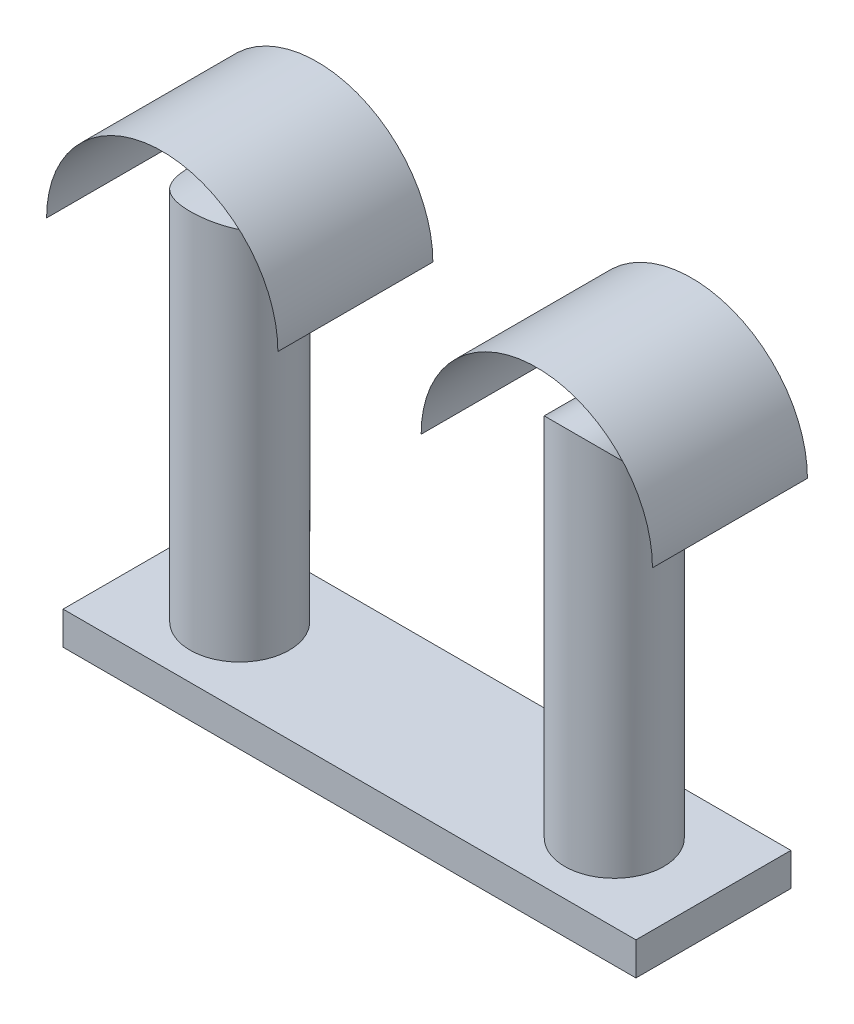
ISO-10303-21;
HEADER;
FILE_DESCRIPTION(('STEP AP214'),'2;1');
FILE_NAME('part.step','',(''),(''),'','','');
FILE_SCHEMA(('AUTOMOTIVE_DESIGN { 1 0 10303 214 1 1 1 1 }'));
ENDSEC;
DATA;
#1=APPLICATION_CONTEXT('core data for automotive mechanical design processes');
#2=APPLICATION_PROTOCOL_DEFINITION('international standard','automotive_design',2000,#1);
#3=PRODUCT_CONTEXT('',#1,'mechanical');
#4=PRODUCT('Part','Part','',(#3));
#5=PRODUCT_RELATED_PRODUCT_CATEGORY('part','',(#4));
#6=PRODUCT_DEFINITION_FORMATION('','',#4);
#7=PRODUCT_DEFINITION_CONTEXT('part definition',#1,'design');
#8=PRODUCT_DEFINITION('design','',#6,#7);
#9=PRODUCT_DEFINITION_SHAPE('','',#8);
#10=(LENGTH_UNIT() NAMED_UNIT(*) SI_UNIT(.MILLI.,.METRE.));
#11=(NAMED_UNIT(*) PLANE_ANGLE_UNIT() SI_UNIT($,.RADIAN.));
#12=(NAMED_UNIT(*) SI_UNIT($,.STERADIAN.) SOLID_ANGLE_UNIT());
#13=UNCERTAINTY_MEASURE_WITH_UNIT(LENGTH_MEASURE(1.E-05),#10,'distance_accuracy_value','');
#14=(GEOMETRIC_REPRESENTATION_CONTEXT(3) GLOBAL_UNCERTAINTY_ASSIGNED_CONTEXT((#13)) GLOBAL_UNIT_ASSIGNED_CONTEXT((#10,
#11,#12)) REPRESENTATION_CONTEXT('',''));
#15=CARTESIAN_POINT('',(0.,0.,0.));
#16=DIRECTION('',(0.,0.,1.));
#17=DIRECTION('',(1.,0.,0.));
#18=AXIS2_PLACEMENT_3D('',#15,#16,#17);
#19=CARTESIAN_POINT('',(56.6767208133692,110.,0.));
#20=DIRECTION('',(0.,0.,1.));
#21=DIRECTION('',(-1.,0.,0.));
#22=AXIS2_PLACEMENT_3D('',#19,#20,#21);
#23=CYLINDRICAL_SURFACE('',#22,35.);
#24=CARTESIAN_POINT('',(56.6767208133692,110.,23.447135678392));
#25=DIRECTION('',(0.,0.,1.));
#26=DIRECTION('',(1.,0.,0.));
#27=AXIS2_PLACEMENT_3D('',#24,#25,#26);
#28=CIRCLE('',#27,35.);
#29=CARTESIAN_POINT('',(91.6767208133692,110.,23.447135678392));
#30=VERTEX_POINT('',#29);
#31=CARTESIAN_POINT('',(21.6767208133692,110.,23.447135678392));
#32=VERTEX_POINT('',#31);
#33=EDGE_CURVE('E81',#30,#32,#28,.T.);
#34=ORIENTED_EDGE('',*,*,#33,.T.);
#35=DIRECTION('',(0.,0.,1.));
#36=VECTOR('',#35,1.);
#37=CARTESIAN_POINT('',(21.6767208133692,110.,0.));
#38=LINE('',#37,#36);
#39=CARTESIAN_POINT('',(21.6767208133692,110.,-23.447135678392));
#40=VERTEX_POINT('',#39);
#41=EDGE_CURVE('E14',#40,#32,#38,.T.);
#42=ORIENTED_EDGE('',*,*,#41,.F.);
#43=CARTESIAN_POINT('',(56.6767208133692,110.,-23.447135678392));
#44=DIRECTION('',(0.,0.,1.));
#45=DIRECTION('',(1.,0.,0.));
#46=AXIS2_PLACEMENT_3D('',#43,#44,#45);
#47=CIRCLE('',#46,35.);
#48=CARTESIAN_POINT('',(91.6767208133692,110.,-23.447135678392));
#49=VERTEX_POINT('',#48);
#50=EDGE_CURVE('E83',#49,#40,#47,.T.);
#51=ORIENTED_EDGE('',*,*,#50,.F.);
#52=DIRECTION('',(0.,0.,1.));
#53=VECTOR('',#52,1.);
#54=CARTESIAN_POINT('',(91.6767208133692,110.,0.));
#55=LINE('',#54,#53);
#56=EDGE_CURVE('E63',#49,#30,#55,.T.);
#57=ORIENTED_EDGE('',*,*,#56,.T.);
#58=EDGE_LOOP('',(#34,#42,#51,#57));
#59=FACE_BOUND('',#58,.T.);
#60=ADVANCED_FACE('F61',(#59),#23,.F.);
#61=OPEN_SHELL('',(#60));
#62=SHELL_BASED_SURFACE_MODEL('B2',(#61));
#63=CARTESIAN_POINT('',(-56.6767208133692,110.,0.));
#64=DIRECTION('',(0.,0.,1.));
#65=DIRECTION('',(1.,0.,0.));
#66=AXIS2_PLACEMENT_3D('',#63,#64,#65);
#67=CYLINDRICAL_SURFACE('',#66,35.);
#68=CARTESIAN_POINT('',(-56.6767208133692,110.,23.447135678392));
#69=DIRECTION('',(0.,0.,-1.));
#70=DIRECTION('',(-1.,0.,0.));
#71=AXIS2_PLACEMENT_3D('',#68,#69,#70);
#72=CIRCLE('',#71,35.);
#73=CARTESIAN_POINT('',(-91.6767208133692,110.,23.447135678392));
#74=VERTEX_POINT('',#73);
#75=CARTESIAN_POINT('',(-21.6767208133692,110.,23.447135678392));
#76=VERTEX_POINT('',#75);
#77=EDGE_CURVE('E131',#74,#76,#72,.T.);
#78=ORIENTED_EDGE('',*,*,#77,.F.);
#79=DIRECTION('',(0.,0.,1.));
#80=VECTOR('',#79,1.);
#81=CARTESIAN_POINT('',(-91.6767208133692,110.,0.));
#82=LINE('',#81,#80);
#83=CARTESIAN_POINT('',(-91.6767208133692,110.,-23.447135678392));
#84=VERTEX_POINT('',#83);
#85=EDGE_CURVE('E124',#84,#74,#82,.T.);
#86=ORIENTED_EDGE('',*,*,#85,.F.);
#87=CARTESIAN_POINT('',(-56.6767208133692,110.,-23.447135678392));
#88=DIRECTION('',(0.,0.,-1.));
#89=DIRECTION('',(-1.,0.,0.));
#90=AXIS2_PLACEMENT_3D('',#87,#88,#89);
#91=CIRCLE('',#90,35.);
#92=CARTESIAN_POINT('',(-21.6767208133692,110.,-23.447135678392));
#93=VERTEX_POINT('',#92);
#94=EDGE_CURVE('E142',#84,#93,#91,.T.);
#95=ORIENTED_EDGE('',*,*,#94,.T.);
#96=DIRECTION('',(0.,0.,1.));
#97=VECTOR('',#96,1.);
#98=CARTESIAN_POINT('',(-21.6767208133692,110.,0.));
#99=LINE('',#98,#97);
#100=EDGE_CURVE('E65',#93,#76,#99,.T.);
#101=ORIENTED_EDGE('',*,*,#100,.T.);
#102=EDGE_LOOP('',(#78,#86,#95,#101));
#103=FACE_BOUND('',#102,.T.);
#104=ADVANCED_FACE('F125',(#103),#67,.F.);
#105=OPEN_SHELL('',(#104));
#106=SHELL_BASED_SURFACE_MODEL('B8',(#105));
#107=CARTESIAN_POINT('',(86.6767208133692,10.,-23.447135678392));
#108=DIRECTION('',(0.,-1.,0.));
#109=DIRECTION('',(0.,0.,-1.));
#110=AXIS2_PLACEMENT_3D('',#107,#108,#109);
#111=PLANE('',#110);
#112=CARTESIAN_POINT('',(-56.6767208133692,10.,0.));
#113=DIRECTION('',(0.,-1.,0.));
#114=DIRECTION('',(0.,0.,-1.));
#115=AXIS2_PLACEMENT_3D('',#112,#113,#114);
#116=CIRCLE('',#115,15.);
#117=CARTESIAN_POINT('',(-56.6767208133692,10.,-15.));
#118=VERTEX_POINT('',#117);
#119=EDGE_CURVE('E177',#118,#118,#116,.F.);
#120=ORIENTED_EDGE('',*,*,#119,.F.);
#121=EDGE_LOOP('',(#120));
#122=FACE_BOUND('',#121,.T.);
#123=DIRECTION('',(0.,0.,-1.));
#124=VECTOR('',#123,1.);
#125=CARTESIAN_POINT('',(86.6767208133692,10.,23.447135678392));
#126=LINE('',#125,#124);
#127=CARTESIAN_POINT('',(86.6767208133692,10.,23.447135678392));
#128=VERTEX_POINT('',#127);
#129=CARTESIAN_POINT('',(86.6767208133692,10.,-23.447135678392));
#130=VERTEX_POINT('',#129);
#131=EDGE_CURVE('E246',#128,#130,#126,.T.);
#132=ORIENTED_EDGE('',*,*,#131,.T.);
#133=DIRECTION('',(-1.,0.,0.));
#134=VECTOR('',#133,1.);
#135=CARTESIAN_POINT('',(-86.6767208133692,10.,-23.447135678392));
#136=LINE('',#135,#134);
#137=CARTESIAN_POINT('',(-86.6767208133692,10.,-23.447135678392));
#138=VERTEX_POINT('',#137);
#139=EDGE_CURVE('E216',#130,#138,#136,.T.);
#140=ORIENTED_EDGE('',*,*,#139,.T.);
#141=DIRECTION('',(0.,0.,1.));
#142=VECTOR('',#141,1.);
#143=CARTESIAN_POINT('',(-86.6767208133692,10.,23.447135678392));
#144=LINE('',#143,#142);
#145=CARTESIAN_POINT('',(-86.6767208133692,10.,23.447135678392));
#146=VERTEX_POINT('',#145);
#147=EDGE_CURVE('E292',#138,#146,#144,.T.);
#148=ORIENTED_EDGE('',*,*,#147,.T.);
#149=DIRECTION('',(1.,0.,0.));
#150=VECTOR('',#149,1.);
#151=CARTESIAN_POINT('',(-86.6767208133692,10.,23.447135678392));
#152=LINE('',#151,#150);
#153=EDGE_CURVE('E190',#146,#128,#152,.T.);
#154=ORIENTED_EDGE('',*,*,#153,.T.);
#155=EDGE_LOOP('',(#132,#140,#148,#154));
#156=FACE_BOUND('',#155,.T.);
#157=CARTESIAN_POINT('',(56.6767208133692,10.,0.));
#158=DIRECTION('',(0.,-1.,0.));
#159=DIRECTION('',(0.,0.,-1.));
#160=AXIS2_PLACEMENT_3D('',#157,#158,#159);
#161=CIRCLE('',#160,15.);
#162=CARTESIAN_POINT('',(56.6767208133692,10.,-15.));
#163=VERTEX_POINT('',#162);
#164=EDGE_CURVE('E119',#163,#163,#161,.F.);
#165=ORIENTED_EDGE('',*,*,#164,.F.);
#166=EDGE_LOOP('',(#165));
#167=FACE_BOUND('',#166,.T.);
#168=ADVANCED_FACE('F167',(#122,#156,#167),#111,.F.);
#169=CARTESIAN_POINT('',(86.6767208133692,10.,23.447135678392));
#170=DIRECTION('',(-1.,0.,0.));
#171=DIRECTION('',(0.,0.,1.));
#172=AXIS2_PLACEMENT_3D('',#169,#170,#171);
#173=PLANE('',#172);
#174=DIRECTION('',(0.,0.,-1.));
#175=VECTOR('',#174,1.);
#176=CARTESIAN_POINT('',(86.6767208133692,0.,23.447135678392));
#177=LINE('',#176,#175);
#178=CARTESIAN_POINT('',(86.6767208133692,0.,23.447135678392));
#179=VERTEX_POINT('',#178);
#180=CARTESIAN_POINT('',(86.6767208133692,0.,-23.447135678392));
#181=VERTEX_POINT('',#180);
#182=EDGE_CURVE('E244',#179,#181,#177,.T.);
#183=ORIENTED_EDGE('',*,*,#182,.T.);
#184=DIRECTION('',(0.,-1.,0.));
#185=VECTOR('',#184,1.);
#186=CARTESIAN_POINT('',(86.6767208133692,10.,-23.447135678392));
#187=LINE('',#186,#185);
#188=EDGE_CURVE('E290',#130,#181,#187,.T.);
#189=ORIENTED_EDGE('',*,*,#188,.F.);
#190=ORIENTED_EDGE('',*,*,#131,.F.);
#191=DIRECTION('',(0.,-1.,0.));
#192=VECTOR('',#191,1.);
#193=CARTESIAN_POINT('',(86.6767208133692,10.,23.447135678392));
#194=LINE('',#193,#192);
#195=EDGE_CURVE('E299',#128,#179,#194,.T.);
#196=ORIENTED_EDGE('',*,*,#195,.T.);
#197=EDGE_LOOP('',(#183,#189,#190,#196));
#198=FACE_BOUND('',#197,.T.);
#199=ADVANCED_FACE('F175',(#198),#173,.F.);
#200=CARTESIAN_POINT('',(-86.6767208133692,10.,-23.447135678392));
#201=DIRECTION('',(0.,0.,1.));
#202=DIRECTION('',(1.,0.,0.));
#203=AXIS2_PLACEMENT_3D('',#200,#201,#202);
#204=PLANE('',#203);
#205=DIRECTION('',(-1.,0.,0.));
#206=VECTOR('',#205,1.);
#207=CARTESIAN_POINT('',(-86.6767208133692,0.,-23.447135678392));
#208=LINE('',#207,#206);
#209=CARTESIAN_POINT('',(-86.6767208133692,0.,-23.447135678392));
#210=VERTEX_POINT('',#209);
#211=EDGE_CURVE('E281',#181,#210,#208,.T.);
#212=ORIENTED_EDGE('',*,*,#211,.T.);
#213=DIRECTION('',(0.,-1.,0.));
#214=VECTOR('',#213,1.);
#215=CARTESIAN_POINT('',(-86.6767208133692,10.,-23.447135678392));
#216=LINE('',#215,#214);
#217=EDGE_CURVE('E283',#138,#210,#216,.T.);
#218=ORIENTED_EDGE('',*,*,#217,.F.);
#219=ORIENTED_EDGE('',*,*,#139,.F.);
#220=ORIENTED_EDGE('',*,*,#188,.T.);
#221=EDGE_LOOP('',(#212,#218,#219,#220));
#222=FACE_BOUND('',#221,.T.);
#223=ADVANCED_FACE('F269',(#222),#204,.F.);
#224=CARTESIAN_POINT('',(-86.6767208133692,10.,23.447135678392));
#225=DIRECTION('',(1.,0.,0.));
#226=DIRECTION('',(0.,0.,-1.));
#227=AXIS2_PLACEMENT_3D('',#224,#225,#226);
#228=PLANE('',#227);
#229=DIRECTION('',(0.,0.,1.));
#230=VECTOR('',#229,1.);
#231=CARTESIAN_POINT('',(-86.6767208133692,0.,23.447135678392));
#232=LINE('',#231,#230);
#233=CARTESIAN_POINT('',(-86.6767208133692,0.,23.447135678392));
#234=VERTEX_POINT('',#233);
#235=EDGE_CURVE('E203',#210,#234,#232,.T.);
#236=ORIENTED_EDGE('',*,*,#235,.T.);
#237=DIRECTION('',(0.,-1.,0.));
#238=VECTOR('',#237,1.);
#239=CARTESIAN_POINT('',(-86.6767208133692,10.,23.447135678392));
#240=LINE('',#239,#238);
#241=EDGE_CURVE('E291',#146,#234,#240,.T.);
#242=ORIENTED_EDGE('',*,*,#241,.F.);
#243=ORIENTED_EDGE('',*,*,#147,.F.);
#244=ORIENTED_EDGE('',*,*,#217,.T.);
#245=EDGE_LOOP('',(#236,#242,#243,#244));
#246=FACE_BOUND('',#245,.T.);
#247=ADVANCED_FACE('F276',(#246),#228,.F.);
#248=CARTESIAN_POINT('',(-86.6767208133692,10.,23.447135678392));
#249=DIRECTION('',(0.,0.,-1.));
#250=DIRECTION('',(-1.,0.,0.));
#251=AXIS2_PLACEMENT_3D('',#248,#249,#250);
#252=PLANE('',#251);
#253=DIRECTION('',(1.,0.,0.));
#254=VECTOR('',#253,1.);
#255=CARTESIAN_POINT('',(-86.6767208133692,0.,23.447135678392));
#256=LINE('',#255,#254);
#257=EDGE_CURVE('E212',#234,#179,#256,.T.);
#258=ORIENTED_EDGE('',*,*,#257,.T.);
#259=ORIENTED_EDGE('',*,*,#195,.F.);
#260=ORIENTED_EDGE('',*,*,#153,.F.);
#261=ORIENTED_EDGE('',*,*,#241,.T.);
#262=EDGE_LOOP('',(#258,#259,#260,#261));
#263=FACE_BOUND('',#262,.T.);
#264=ADVANCED_FACE('F273',(#263),#252,.F.);
#265=CARTESIAN_POINT('',(86.6767208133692,0.,-23.447135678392));
#266=DIRECTION('',(0.,-1.,0.));
#267=DIRECTION('',(0.,0.,-1.));
#268=AXIS2_PLACEMENT_3D('',#265,#266,#267);
#269=PLANE('',#268);
#270=ORIENTED_EDGE('',*,*,#182,.F.);
#271=ORIENTED_EDGE('',*,*,#257,.F.);
#272=ORIENTED_EDGE('',*,*,#235,.F.);
#273=ORIENTED_EDGE('',*,*,#211,.F.);
#274=EDGE_LOOP('',(#270,#271,#272,#273));
#275=FACE_BOUND('',#274,.T.);
#276=ADVANCED_FACE('F275',(#275),#269,.T.);
#277=CARTESIAN_POINT('',(-56.6767208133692,165.001,0.));
#278=DIRECTION('',(0.,-1.,0.));
#279=DIRECTION('',(0.,0.,-1.));
#280=AXIS2_PLACEMENT_3D('',#277,#278,#279);
#281=CYLINDRICAL_SURFACE('',#280,15.);
#282=CARTESIAN_POINT('',(-56.6767208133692,125.,-15.));
#283=CARTESIAN_POINT('',(-56.2758116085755,124.999997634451,-14.9999971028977));
#284=CARTESIAN_POINT('',(-55.8747809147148,124.993093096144,-14.9839057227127));
#285=CARTESIAN_POINT('',(-55.0755880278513,124.965646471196,-14.9196934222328));
#286=CARTESIAN_POINT('',(-54.6774277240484,124.945096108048,-14.8715530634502));
#287=CARTESIAN_POINT('',(-53.8862021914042,124.890838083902,-14.7436069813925));
#288=CARTESIAN_POINT('',(-53.4931505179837,124.857100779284,-14.6637299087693));
#289=CARTESIAN_POINT('',(-52.7159437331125,124.777361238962,-14.4731590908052));
#290=CARTESIAN_POINT('',(-52.3317873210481,124.731360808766,-14.3624698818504));
#291=CARTESIAN_POINT('',(-51.5761819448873,124.628447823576,-14.1117825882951));
#292=CARTESIAN_POINT('',(-51.2046936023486,124.571573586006,-13.9718872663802));
#293=CARTESIAN_POINT('',(-50.4753046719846,124.448211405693,-13.6637911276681));
#294=CARTESIAN_POINT('',(-50.1174045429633,124.381723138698,-13.4955893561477));
#295=CARTESIAN_POINT('',(-49.4174207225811,124.240764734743,-13.1323253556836));
#296=CARTESIAN_POINT('',(-49.0753284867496,124.166298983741,-12.9372778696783));
#297=CARTESIAN_POINT('',(-48.40841435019,124.011062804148,-12.5215646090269));
#298=CARTESIAN_POINT('',(-48.0835992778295,123.93028991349,-12.3008888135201));
#299=CARTESIAN_POINT('',(-47.4379000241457,123.760345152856,-11.8242471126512));
#300=CARTESIAN_POINT('',(-47.1179455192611,123.670956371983,-11.5670986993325));
#301=CARTESIAN_POINT('',(-46.5005755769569,123.489544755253,-11.0278766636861));
#302=CARTESIAN_POINT('',(-46.2031610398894,123.397521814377,-10.7458020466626));
#303=CARTESIAN_POINT('',(-45.6323140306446,123.213116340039,-10.1581955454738));
#304=CARTESIAN_POINT('',(-45.3588923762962,123.120733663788,-9.85265319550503));
#305=CARTESIAN_POINT('',(-44.8376558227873,122.938015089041,-9.21979517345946));
#306=CARTESIAN_POINT('',(-44.5898451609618,122.847679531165,-8.89247591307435));
#307=CARTESIAN_POINT('',(-44.1089484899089,122.666811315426,-8.19988511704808));
#308=CARTESIAN_POINT('',(-43.8773403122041,122.576522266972,-7.83352144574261));
#309=CARTESIAN_POINT('',(-43.4461006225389,122.403775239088,-7.08086972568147));
#310=CARTESIAN_POINT('',(-43.2464558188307,122.321314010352,-6.69459004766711));
#311=CARTESIAN_POINT('',(-42.8808216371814,122.166948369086,-5.90445692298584));
#312=CARTESIAN_POINT('',(-42.7148256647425,122.0950418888,-5.50060693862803));
#313=CARTESIAN_POINT('',(-42.4181548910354,121.964349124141,-4.67807553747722));
#314=CARTESIAN_POINT('',(-42.2874772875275,121.90556179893,-4.25939530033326));
#315=CARTESIAN_POINT('',(-42.0685912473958,121.805915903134,-3.43169282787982));
#316=CARTESIAN_POINT('',(-41.9785838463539,121.764306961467,-3.02323680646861));
#317=CARTESIAN_POINT('',(-41.832879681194,121.696480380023,-2.19897823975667));
#318=CARTESIAN_POINT('',(-41.7771818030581,121.670262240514,-1.7831759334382));
#319=CARTESIAN_POINT('',(-41.7008286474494,121.634229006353,-0.947870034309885));
#320=CARTESIAN_POINT('',(-41.6801553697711,121.624405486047,-0.528368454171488));
#321=CARTESIAN_POINT('',(-41.674074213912,121.621521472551,0.310936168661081));
#322=CARTESIAN_POINT('',(-41.688664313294,121.628460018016,0.730739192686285));
#323=CARTESIAN_POINT('',(-41.7502627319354,121.657571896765,1.53266432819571));
#324=CARTESIAN_POINT('',(-41.7945104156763,121.67844732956,1.91504971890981));
#325=CARTESIAN_POINT('',(-41.9120510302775,121.733400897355,2.67433973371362));
#326=CARTESIAN_POINT('',(-41.9853421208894,121.767478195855,3.05124470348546));
#327=CARTESIAN_POINT('',(-42.1602324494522,121.847775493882,3.7971494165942));
#328=CARTESIAN_POINT('',(-42.2618359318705,121.893997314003,4.16614796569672));
#329=CARTESIAN_POINT('',(-42.4923982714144,121.997201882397,4.89394777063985));
#330=CARTESIAN_POINT('',(-42.6213582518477,122.054185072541,5.25274860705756));
#331=CARTESIAN_POINT('',(-42.9086212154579,122.178633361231,5.96576381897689));
#332=CARTESIAN_POINT('',(-43.067497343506,122.246298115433,6.31971214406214));
#333=CARTESIAN_POINT('',(-43.4115086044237,122.389332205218,7.01313102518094));
#334=CARTESIAN_POINT('',(-43.5966532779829,122.464704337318,7.35259626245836));
#335=CARTESIAN_POINT('',(-43.9919414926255,122.621182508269,8.01531402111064));
#336=CARTESIAN_POINT('',(-44.2020885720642,122.70228935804,8.33856423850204));
#337=CARTESIAN_POINT('',(-44.6461227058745,122.868235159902,8.96732162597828));
#338=CARTESIAN_POINT('',(-44.8800111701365,122.953074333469,9.2728277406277));
#339=CARTESIAN_POINT('',(-45.3924177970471,123.132229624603,9.89141119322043));
#340=CARTESIAN_POINT('',(-45.6730586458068,123.226710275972,10.2026855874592));
#341=CARTESIAN_POINT('',(-46.2593461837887,123.415162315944,10.8006280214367));
#342=CARTESIAN_POINT('',(-46.5649832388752,123.509133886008,11.0873054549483));
#343=CARTESIAN_POINT('',(-47.1999074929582,123.694204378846,11.63468111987));
#344=CARTESIAN_POINT('',(-47.5292108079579,123.78530128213,11.8953613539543));
#345=CARTESIAN_POINT('',(-48.2093334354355,123.962136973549,12.388694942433));
#346=CARTESIAN_POINT('',(-48.560143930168,124.047877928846,12.6213596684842));
#347=CARTESIAN_POINT('',(-49.2908021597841,124.213917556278,13.0627356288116));
#348=CARTESIAN_POINT('',(-49.6711679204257,124.294016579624,13.2706661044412));
#349=CARTESIAN_POINT('',(-50.4501435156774,124.443969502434,13.6535001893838));
#350=CARTESIAN_POINT('',(-50.8487538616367,124.513823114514,13.8284028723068));
#351=CARTESIAN_POINT('',(-51.6612178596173,124.641214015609,14.1433536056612));
#352=CARTESIAN_POINT('',(-52.0750642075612,124.69875711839,14.2834181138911));
#353=CARTESIAN_POINT('',(-52.9149833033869,124.799830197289,14.5272333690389));
#354=CARTESIAN_POINT('',(-53.3410550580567,124.843361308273,14.6309870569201));
#355=CARTESIAN_POINT('',(-54.173404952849,124.912692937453,14.7953129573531));
#356=CARTESIAN_POINT('',(-54.5791282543,124.939475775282,14.8582874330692));
#357=CARTESIAN_POINT('',(-55.3950502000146,124.978909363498,14.9507813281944));
#358=CARTESIAN_POINT('',(-55.8052486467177,124.991560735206,14.980302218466));
#359=CARTESIAN_POINT('',(-56.6267640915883,125.002374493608,15.005543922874));
#360=CARTESIAN_POINT('',(-57.0380807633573,125.000540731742,15.0012737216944));
#361=CARTESIAN_POINT('',(-57.8586509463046,124.982444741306,14.9590042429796));
#362=CARTESIAN_POINT('',(-58.2679045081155,124.96618286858,14.9210057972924));
#363=CARTESIAN_POINT('',(-59.0594520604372,124.920929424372,14.8146373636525));
#364=CARTESIAN_POINT('',(-59.4420211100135,124.892661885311,14.7479925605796));
#365=CARTESIAN_POINT('',(-60.1998166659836,124.824309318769,14.5855390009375));
#366=CARTESIAN_POINT('',(-60.5750434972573,124.784224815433,14.4897315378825));
#367=CARTESIAN_POINT('',(-61.3157828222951,124.693203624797,14.2698418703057));
#368=CARTESIAN_POINT('',(-61.6812946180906,124.642266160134,14.1457576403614));
#369=CARTESIAN_POINT('',(-62.4004015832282,124.53073835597,13.8703904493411));
#370=CARTESIAN_POINT('',(-62.7539963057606,124.470147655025,13.7191064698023));
#371=CARTESIAN_POINT('',(-63.4581208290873,124.338678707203,13.385406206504));
#372=CARTESIAN_POINT('',(-63.8082111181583,124.267538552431,13.2021661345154));
#373=CARTESIAN_POINT('',(-64.4917248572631,124.118149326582,12.8094141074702));
#374=CARTESIAN_POINT('',(-64.825148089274,124.039900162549,12.5999018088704));
#375=CARTESIAN_POINT('',(-65.4737026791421,123.878087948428,12.1559683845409));
#376=CARTESIAN_POINT('',(-65.7888304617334,123.794523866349,11.9215424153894));
#377=CARTESIAN_POINT('',(-66.3993040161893,123.623977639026,11.4291394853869));
#378=CARTESIAN_POINT('',(-66.6946426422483,123.536994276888,11.1711540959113));
#379=CARTESIAN_POINT('',(-67.2854534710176,123.355020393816,10.6128306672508));
#380=CARTESIAN_POINT('',(-67.5792629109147,123.259919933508,10.3107664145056));
#381=CARTESIAN_POINT('',(-68.1405896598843,123.070643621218,9.68282409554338));
#382=CARTESIAN_POINT('',(-68.4081052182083,122.976467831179,9.35694444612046));
#383=CARTESIAN_POINT('',(-68.9153204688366,122.791608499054,8.68300744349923));
#384=CARTESIAN_POINT('',(-69.1550066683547,122.700926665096,8.3349394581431));
#385=CARTESIAN_POINT('',(-69.6046822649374,122.52577490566,7.61882491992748));
#386=CARTESIAN_POINT('',(-69.8146834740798,122.441302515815,7.2507863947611));
#387=CARTESIAN_POINT('',(-70.2070119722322,122.279669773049,6.48982121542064));
#388=CARTESIAN_POINT('',(-70.3887637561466,122.202671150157,6.09656276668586));
#389=CARTESIAN_POINT('',(-70.7181761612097,122.060407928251,5.29393031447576));
#390=CARTESIAN_POINT('',(-70.8658360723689,121.995143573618,4.88455597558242));
#391=CARTESIAN_POINT('',(-71.1253553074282,121.878789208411,4.05296544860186));
#392=CARTESIAN_POINT('',(-71.237241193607,121.827688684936,3.63075904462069));
#393=CARTESIAN_POINT('',(-71.4239707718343,121.741601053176,2.77662714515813));
#394=CARTESIAN_POINT('',(-71.4988182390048,121.706612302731,2.34470264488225));
#395=CARTESIAN_POINT('',(-71.6059768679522,121.656286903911,1.50993157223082));
#396=CARTESIAN_POINT('',(-71.6412259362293,121.639595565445,1.10754156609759));
#397=CARTESIAN_POINT('',(-71.679135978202,121.621638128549,0.300893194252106));
#398=CARTESIAN_POINT('',(-71.6817987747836,121.620371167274,-0.103365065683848));
#399=CARTESIAN_POINT('',(-71.6545073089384,121.633307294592,-0.910458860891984));
#400=CARTESIAN_POINT('',(-71.62455817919,121.647507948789,-1.31329461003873));
#401=CARTESIAN_POINT('',(-71.5324176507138,121.69086390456,-2.11443773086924));
#402=CARTESIAN_POINT('',(-71.4702266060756,121.720019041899,-2.51274515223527));
#403=CARTESIAN_POINT('',(-71.3184048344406,121.790370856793,-3.28122050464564));
#404=CARTESIAN_POINT('',(-71.2303760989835,121.830859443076,-3.65177192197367));
#405=CARTESIAN_POINT('',(-71.0268674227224,121.923122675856,-4.38378879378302));
#406=CARTESIAN_POINT('',(-70.9113887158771,121.974896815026,-4.7452546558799));
#407=CARTESIAN_POINT('',(-70.653981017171,122.088252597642,-5.45705452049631));
#408=CARTESIAN_POINT('',(-70.5120509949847,122.149834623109,-5.80738808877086));
#409=CARTESIAN_POINT('',(-70.2027861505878,122.281167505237,-6.49521469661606));
#410=CARTESIAN_POINT('',(-70.0354414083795,122.350921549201,-6.83270265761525));
#411=CARTESIAN_POINT('',(-69.6654330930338,122.501317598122,-7.51349262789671));
#412=CARTESIAN_POINT('',(-69.4612265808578,122.58236597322,-7.85586655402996));
#413=CARTESIAN_POINT('',(-69.0268638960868,122.749474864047,-8.52245531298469));
#414=CARTESIAN_POINT('',(-68.7967060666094,122.835535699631,-8.84666898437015));
#415=CARTESIAN_POINT('',(-68.3117534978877,123.010490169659,-9.47542485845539));
#416=CARTESIAN_POINT('',(-68.0569529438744,123.099384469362,-9.77996238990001));
#417=CARTESIAN_POINT('',(-67.5240906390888,123.277823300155,-10.3678342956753));
#418=CARTESIAN_POINT('',(-67.2460250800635,123.3673679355,-10.6511651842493));
#419=CARTESIAN_POINT('',(-66.6451577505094,123.55199961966,-11.2166689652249));
#420=CARTESIAN_POINT('',(-66.3205571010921,123.646964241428,-11.4969744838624));
#421=CARTESIAN_POINT('',(-65.6478968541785,123.832523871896,-12.0292091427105));
#422=CARTESIAN_POINT('',(-65.2998456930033,123.923120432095,-12.2811484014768));
#423=CARTESIAN_POINT('',(-64.5819303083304,124.097568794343,-12.7551085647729));
#424=CARTESIAN_POINT('',(-64.2120501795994,124.181415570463,-12.9771072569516));
#425=CARTESIAN_POINT('',(-63.453019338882,124.339948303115,-13.3891080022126));
#426=CARTESIAN_POINT('',(-63.0638701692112,124.414634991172,-13.5791126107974));
#427=CARTESIAN_POINT('',(-62.2746744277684,124.551714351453,-13.9228390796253));
#428=CARTESIAN_POINT('',(-61.8748689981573,124.614270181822,-14.0770489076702));
#429=CARTESIAN_POINT('',(-61.06181265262,124.726637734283,-14.3511327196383));
#430=CARTESIAN_POINT('',(-60.6485595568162,124.776447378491,-14.471001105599));
#431=CARTESIAN_POINT('',(-59.8130562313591,124.861716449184,-14.6747337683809));
#432=CARTESIAN_POINT('',(-59.3908341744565,124.897215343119,-14.7586971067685));
#433=CARTESIAN_POINT('',(-58.5399569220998,124.952966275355,-14.8900443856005));
#434=CARTESIAN_POINT('',(-58.1113065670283,124.973229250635,-14.9374545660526));
#435=CARTESIAN_POINT('',(-57.5141865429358,124.990380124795,-14.9775419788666));
#436=CARTESIAN_POINT('',(-57.3468326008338,124.993985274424,-14.9859610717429));
#437=CARTESIAN_POINT('',(-57.0118997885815,124.998795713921,-14.9971907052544));
#438=CARTESIAN_POINT('',(-56.8443209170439,125.000000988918,-15.0000012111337));
#439=CARTESIAN_POINT('',(-56.6767208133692,125.,-15.));
#440=B_SPLINE_CURVE_WITH_KNOTS('',3,(#282,#283,#284,#285,#286,#287,#288,#289,#290,#291,#292,
#293,#294,#295,#296,#297,#298,#299,#300,#301,#302,#303,#304,#305,#306,#307,#308,#309,#310,#311,
#312,#313,#314,#315,#316,#317,#318,#319,#320,#321,#322,#323,#324,#325,#326,#327,#328,#329,#330,
#331,#332,#333,#334,#335,#336,#337,#338,#339,#340,#341,#342,#343,#344,#345,#346,#347,#348,#349,
#350,#351,#352,#353,#354,#355,#356,#357,#358,#359,#360,#361,#362,#363,#364,#365,#366,#367,#368,
#369,#370,#371,#372,#373,#374,#375,#376,#377,#378,#379,#380,#381,#382,#383,#384,#385,#386,#387,
#388,#389,#390,#391,#392,#393,#394,#395,#396,#397,#398,#399,#400,#401,#402,#403,#404,#405,#406,
#407,#408,#409,#410,#411,#412,#413,#414,#415,#416,#417,#418,#419,#420,#421,#422,#423,#424,#425,
#426,#427,#428,#429,#430,#431,#432,#433,#434,#435,#436,#437,#438,#439),.UNSPECIFIED.,.T.,.F.,(4,
2,2,2,2,2,2,2,2,2,2,2,2,2,2,2,2,2,2,2,2,2,2,2,2,2,2,2,2,2,2,2,2,2,2,2,2,2,2,2,2,2,2,2,2,2,2,2,2,
2,2,2,2,2,2,2,2,2,2,2,2,2,2,2,2,2,2,2,2,2,2,2,2,2,2,2,2,2,4),(0.,1.20255810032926,
2.40584624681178,3.6118550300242,4.81768634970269,6.01934433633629,7.22104286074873,
8.42208405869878,9.623596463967,10.8825284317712,12.1415106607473,13.4010576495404,
14.6608126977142,15.9873754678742,17.3133851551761,18.6391347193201,19.9647790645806,
21.2240419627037,22.4832639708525,23.7418386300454,25.0003411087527,26.1554931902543,
27.3105720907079,28.4658242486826,29.6211238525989,30.8013538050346,31.9820135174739,
33.1628405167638,34.3437376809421,35.6311581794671,36.9180847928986,38.205896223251,
39.493183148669,40.8139640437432,42.1347819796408,43.4549747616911,44.7750605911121,
46.007830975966,47.2405471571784,48.4729355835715,49.7052936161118,50.872023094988,
52.0387008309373,53.205462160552,54.3722671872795,55.5754618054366,56.7786721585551,
57.9821168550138,59.1859937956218,60.4804744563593,61.7750412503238,63.0702331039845,
64.3649081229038,65.6832297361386,67.0015788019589,68.3189467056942,69.6361803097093,
70.8474299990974,72.058611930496,73.269603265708,74.4805813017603,75.62833987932,
76.7760468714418,77.9237985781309,79.0719994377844,80.2911093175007,81.5102970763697,
82.7297732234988,83.9494493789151,85.2656822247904,86.581444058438,87.8981767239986,
89.2148041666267,90.5122627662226,91.8099327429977,93.1039989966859,94.3971354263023,
94.899861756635,95.402591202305),.UNSPECIFIED.);
#441=CARTESIAN_POINT('',(-56.6767208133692,125.,-15.));
#442=VERTEX_POINT('',#441);
#443=EDGE_CURVE('E235',#442,#442,#440,.T.);
#444=ORIENTED_EDGE('',*,*,#443,.T.);
#445=EDGE_LOOP('',(#444));
#446=FACE_BOUND('',#445,.T.);
#447=ORIENTED_EDGE('',*,*,#119,.T.);
#448=EDGE_LOOP('',(#447));
#449=FACE_BOUND('',#448,.T.);
#450=ADVANCED_FACE('F247',(#446,#449),#281,.T.);
#451=CARTESIAN_POINT('',(-56.6767208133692,90.,0.));
#452=DIRECTION('',(0.,0.,1.));
#453=DIRECTION('',(1.,0.,0.));
#454=AXIS2_PLACEMENT_3D('',#451,#452,#453);
#455=CYLINDRICAL_SURFACE('',#454,35.);
#456=ORIENTED_EDGE('',*,*,#443,.F.);
#457=EDGE_LOOP('',(#456));
#458=FACE_BOUND('',#457,.T.);
#459=ADVANCED_FACE('F252',(#458),#455,.T.);
#460=CARTESIAN_POINT('',(56.6767208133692,165.001,0.));
#461=DIRECTION('',(0.,-1.,0.));
#462=DIRECTION('',(0.,0.,-1.));
#463=AXIS2_PLACEMENT_3D('',#460,#461,#462);
#464=CYLINDRICAL_SURFACE('',#463,15.);
#465=CARTESIAN_POINT('',(56.6767208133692,110.,0.));
#466=DIRECTION('',(0.,-0.707106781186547,-0.707106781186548));
#467=DIRECTION('',(0.,-0.707106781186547,0.707106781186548));
#468=AXIS2_PLACEMENT_3D('',#465,#466,#467);
#469=ELLIPSE('',#468,21.2132034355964,15.);
#470=CARTESIAN_POINT('',(41.6767208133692,110.,0.));
#471=VERTEX_POINT('',#470);
#472=CARTESIAN_POINT('',(71.6767208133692,110.,0.));
#473=VERTEX_POINT('',#472);
#474=EDGE_CURVE('E229',#471,#473,#469,.T.);
#475=ORIENTED_EDGE('',*,*,#474,.T.);
#476=CARTESIAN_POINT('',(56.6767208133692,110.,0.));
#477=DIRECTION('',(0.,-0.707106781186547,0.707106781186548));
#478=DIRECTION('',(0.,-0.707106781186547,-0.707106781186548));
#479=AXIS2_PLACEMENT_3D('',#476,#477,#478);
#480=ELLIPSE('',#479,21.2132034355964,15.);
#481=EDGE_CURVE('E227',#473,#471,#480,.T.);
#482=ORIENTED_EDGE('',*,*,#481,.T.);
#483=EDGE_LOOP('',(#475,#482));
#484=FACE_BOUND('',#483,.T.);
#485=ORIENTED_EDGE('',*,*,#164,.T.);
#486=EDGE_LOOP('',(#485));
#487=FACE_BOUND('',#486,.T.);
#488=ADVANCED_FACE('F234',(#484,#487),#464,.T.);
#489=CARTESIAN_POINT('',(56.6767208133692,110.,0.));
#490=DIRECTION('',(0.,0.,1.));
#491=DIRECTION('',(-1.,0.,0.));
#492=AXIS2_PLACEMENT_3D('',#489,#490,#491);
#493=CYLINDRICAL_SURFACE('',#492,15.);
#494=ORIENTED_EDGE('',*,*,#474,.F.);
#495=ORIENTED_EDGE('',*,*,#481,.F.);
#496=EDGE_LOOP('',(#494,#495));
#497=FACE_BOUND('',#496,.T.);
#498=ADVANCED_FACE('F230',(#497),#493,.T.);
#499=CLOSED_SHELL('',(#168,#199,#223,#247,#264,#276,#450,#459,#488,#498));
#500=MANIFOLD_SOLID_BREP('B57',#499);
#501=ADVANCED_BREP_SHAPE_REPRESENTATION('',(#18,#500),#14);
#502=MANIFOLD_SURFACE_SHAPE_REPRESENTATION('',(#18,#62,#106),#14);
#503=SHAPE_REPRESENTATION('',(#18),#14);
#504=SHAPE_DEFINITION_REPRESENTATION(#9,#503);
#505=SHAPE_REPRESENTATION_RELATIONSHIP('','',#503,#501);
#506=SHAPE_REPRESENTATION_RELATIONSHIP('','',#503,#502);
ENDSEC;
END-ISO-10303-21;
